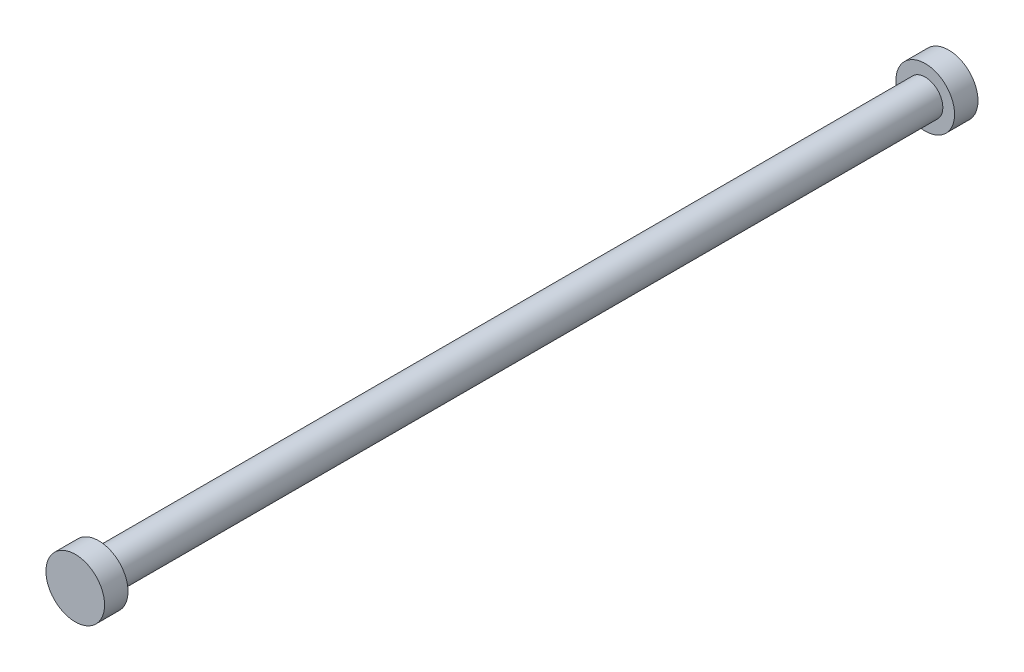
from build123d import *

# Parameters (mm, degrees)
SKETCH_1_R                 = 10
ROLLER_AXLE_BLANK_DEPTH    = 149
SKETCH_2_R                 = 12
SKETCH_2_R_2               = 6
AXLE_D12_ROLLERS_D20_DEPTH = 141


with BuildPart() as part:
    # Sketch 1 → Roller_Axle_Blank (new, symmetric)
    with BuildSketch(Plane.XY):
        Circle(SKETCH_1_R)
    extrude(amount=ROLLER_AXLE_BLANK_DEPTH, both=True)

    # Sketch 2 → Axle_D12_Rollers_D20 (cut, symmetric)
    with BuildSketch(Plane.XY):
        Circle(SKETCH_2_R)
        Circle(SKETCH_2_R_2, mode=Mode.SUBTRACT)
    extrude(amount=AXLE_D12_ROLLERS_D20_DEPTH, both=True, mode=Mode.SUBTRACT)


solid = part.part
